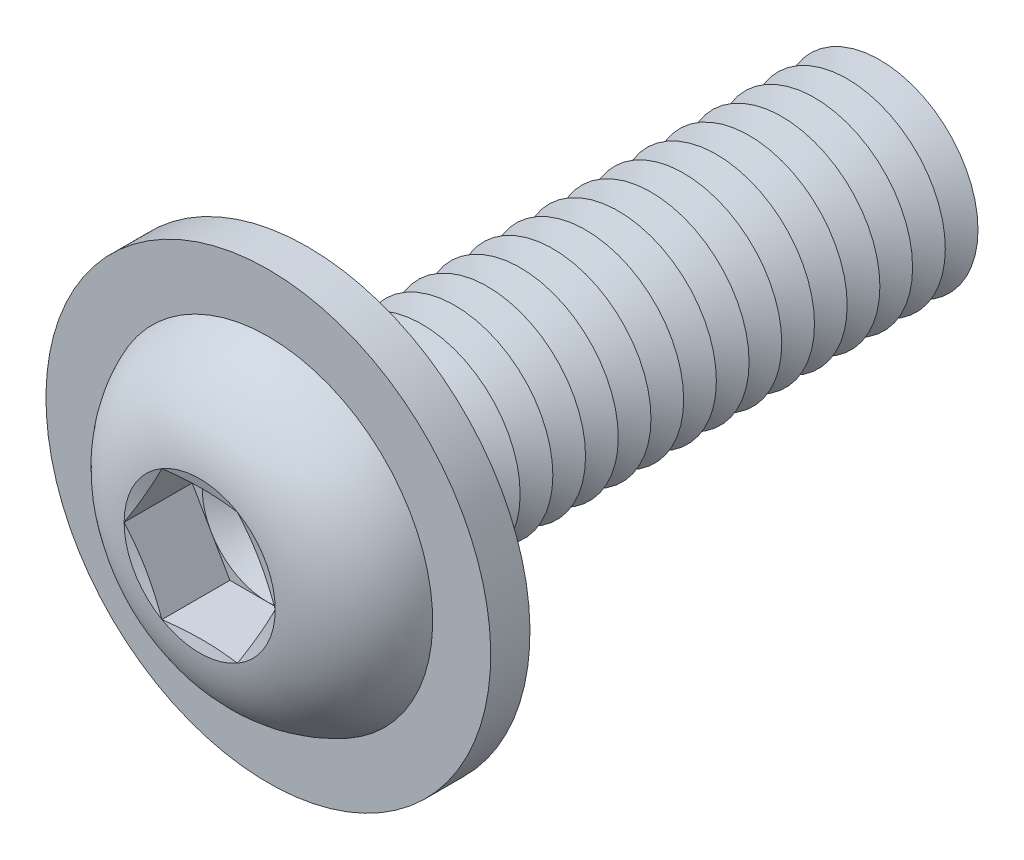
from build123d import *

# Parameters (mm, degrees)
FILLET1_R           = 0.5
LPATTERN1_COUNT     = 18
LPATTERN1_PITCH     = 1
CUT_EXTRUDE1_DEPTH  = 2.08
SKETCH5_R           = 6.8
SKETCH5_R_2         = 3.5
BOSS_EXTRUDE1_DEPTH = 1.2


with BuildPart() as part:
    # Sketch1 → Revolve1 (revolve)
    with BuildSketch(Plane(origin=(0, 0, 0), x_dir=(0, 0, -1), z_dir=(1, 0, 0)), mode=Mode.PRIVATE) as revolve1_sk:
        with BuildLine():
            Line((0, 3), (0, 5.25))
            ThreePointArc((0, 5.25), (-2.210041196, 4.408189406), (-3.3, 2.3094))
            Line((-3.3, 2.3094), (-2.990599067, 1.1547))
            Line((-2.990599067, 1.1547), (-3.3, 1.1547))
            Line((-3.3, 1.1547), (-3.3, 0))
            Line((-3.3, 0), (18, 0))
            Line((18, 0), (18, 3))
            Line((18, 3), (0, 3))
        make_face()
    revolve(revolve1_sk.sketch.rotate(Axis((0, 0, -18), (0, 0, 1)), 90), axis=Axis((0, 0, -18), (0, 0, 1)))

    # Fillet1
    fillet1_edges = [part.edges().sort_by_distance(p)[0] for p in [
        (3, 0, 0),
    ]]
    fillet(fillet1_edges, radius=FILLET1_R)

    # Sketch2 → Cut-Revolve1 (revolve, cut)
    with BuildSketch(Plane(origin=(0, 0, 0), x_dir=(0, 0, -1), z_dir=(1, 0, 0)), mode=Mode.PRIVATE) as cut_revolve1_sk:
        Polygon((17.5, 3), (18.5, 3), (18, 2.133974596), align=None)
    cut_revolve1 = revolve(cut_revolve1_sk.sketch.rotate(Axis((0, 0, -18), (0, 0, -1)), 270), axis=Axis((0, 0, -18), (0, 0, -1)), mode=Mode.SUBTRACT)

    # LPattern1: Cut-Revolve1 ×18
    with Locations(*[(0, 0, i * LPATTERN1_PITCH) for i in range(1, LPATTERN1_COUNT)]):
        add(cut_revolve1, mode=Mode.SUBTRACT)

    # Sketch3 → Cut-Extrude1 (cut)
    with BuildSketch(Plane.XY.offset(3.3)):
        Polygon((1.1547, 1.999999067), (-1.1547, 1.999999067), (-2.3094, 0), (-1.1547, -1.999999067), (1.1547, -1.999999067), (2.3094, 0), align=None)
    extrude(amount=-CUT_EXTRUDE1_DEPTH, mode=Mode.SUBTRACT)

    # Cut-Extrude2 cone 1 section (on through the dimple's axis) → Cut-Extrude2 (revolve, cut)
    with BuildSketch(Plane(origin=(0, 0, 1.22), x_dir=(0, -1, 0), z_dir=(1, 0, 0))):
        Polygon((0, 0), (1.999999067, 0), (0, 1.1547), align=None)
    revolve(axis=Axis((0, 0, 1.22), (0, 0, -1)), mode=Mode.SUBTRACT)

    # Sketch5 → Boss-Extrude1 (add)
    with BuildSketch(Plane(origin=(0, 0, 0), x_dir=(-1, 0, 0), z_dir=(0, 0, -1))):
        with Locations(Location((0, 0, 0), (0, 0, 90))):
            Circle(SKETCH5_R)
        Circle(SKETCH5_R_2, mode=Mode.SUBTRACT)
    extrude(amount=-BOSS_EXTRUDE1_DEPTH)


solid = part.part
